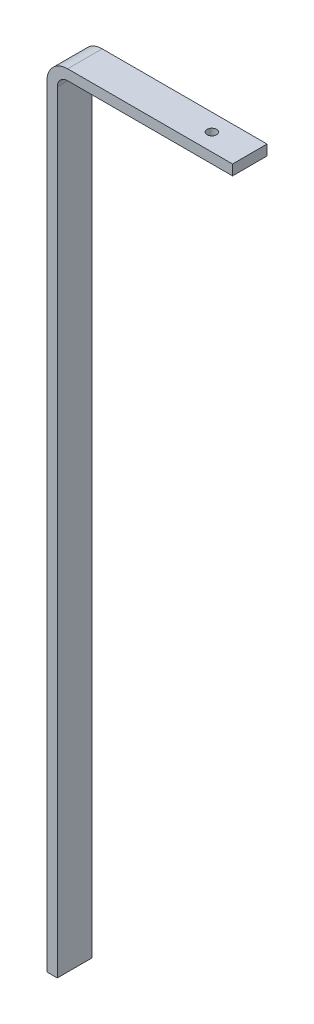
from build123d import *

# Parameters (mm, degrees)
BOSS_EXTRU_1_DEPTH = 20
D_GAGEMENT_M51_D   = 5.5


with BuildPart() as part:
    # Esquisse1 → Boss.-Extru.1 (new body)
    with BuildSketch(Plane.XY):
        with BuildLine():
            Line((95.5, 12), (0, 12))
            ThreePointArc((0, 12), (-8.485281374, 8.485281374), (-12, 0))
            Line((-12, 0), (-12, -447))
            Line((-12, -447), (-6, -447))
            Line((-6, -447), (-6, 0))
            ThreePointArc((-6, 0), (-4.242640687, 4.242640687), (0, 6))
            Line((0, 6), (95.5, 6))
            Line((95.5, 6), (95.5, 12))
        make_face()
    extrude(amount=BOSS_EXTRU_1_DEPTH)

    # D_gagement M51 (through all)
    with Locations(Plane(origin=(0, 12, 0), x_dir=(-1, 0, 0), z_dir=(0, 1, 0))):
        with Locations((-73.5, 10)):
            Hole(D_GAGEMENT_M51_D / 2)


solid = part.part
